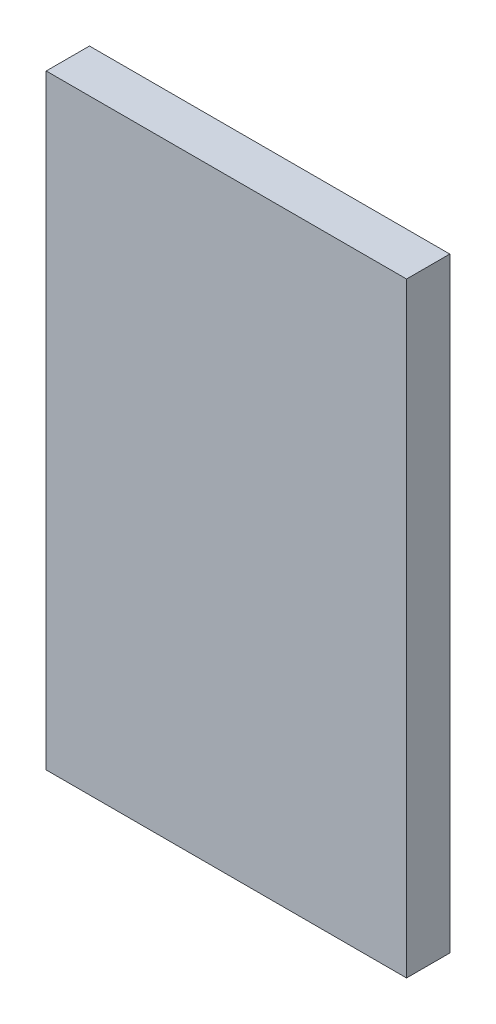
ISO-10303-21;
HEADER;
FILE_DESCRIPTION(('STEP AP214'),'2;1');
FILE_NAME('part.step','',(''),(''),'','','');
FILE_SCHEMA(('AUTOMOTIVE_DESIGN { 1 0 10303 214 1 1 1 1 }'));
ENDSEC;
DATA;
#1=APPLICATION_CONTEXT('core data for automotive mechanical design processes');
#2=APPLICATION_PROTOCOL_DEFINITION('international standard','automotive_design',2000,#1);
#3=PRODUCT_CONTEXT('',#1,'mechanical');
#4=PRODUCT('Part','Part','',(#3));
#5=PRODUCT_RELATED_PRODUCT_CATEGORY('part','',(#4));
#6=PRODUCT_DEFINITION_FORMATION('','',#4);
#7=PRODUCT_DEFINITION_CONTEXT('part definition',#1,'design');
#8=PRODUCT_DEFINITION('design','',#6,#7);
#9=PRODUCT_DEFINITION_SHAPE('','',#8);
#10=(LENGTH_UNIT() NAMED_UNIT(*) SI_UNIT(.MILLI.,.METRE.));
#11=(NAMED_UNIT(*) PLANE_ANGLE_UNIT() SI_UNIT($,.RADIAN.));
#12=(NAMED_UNIT(*) SI_UNIT($,.STERADIAN.) SOLID_ANGLE_UNIT());
#13=UNCERTAINTY_MEASURE_WITH_UNIT(LENGTH_MEASURE(1.E-05),#10,'distance_accuracy_value','');
#14=(GEOMETRIC_REPRESENTATION_CONTEXT(3) GLOBAL_UNCERTAINTY_ASSIGNED_CONTEXT((#13)) GLOBAL_UNIT_ASSIGNED_CONTEXT((#10,
#11,#12)) REPRESENTATION_CONTEXT('',''));
#15=CARTESIAN_POINT('',(0.,0.,0.));
#16=DIRECTION('',(0.,0.,1.));
#17=DIRECTION('',(1.,0.,0.));
#18=AXIS2_PLACEMENT_3D('',#15,#16,#17);
#19=CARTESIAN_POINT('',(0.,0.,30.));
#20=DIRECTION('',(1.,0.,0.));
#21=DIRECTION('',(0.,0.,-1.));
#22=AXIS2_PLACEMENT_3D('',#19,#20,#21);
#23=PLANE('',#22);
#24=DIRECTION('',(0.,-1.,0.));
#25=VECTOR('',#24,1.);
#26=CARTESIAN_POINT('',(0.,0.,0.));
#27=LINE('',#26,#25);
#28=CARTESIAN_POINT('',(0.,420.,0.));
#29=VERTEX_POINT('',#28);
#30=CARTESIAN_POINT('',(0.,0.,0.));
#31=VERTEX_POINT('',#30);
#32=EDGE_CURVE('E99',#29,#31,#27,.T.);
#33=ORIENTED_EDGE('',*,*,#32,.T.);
#34=DIRECTION('',(0.,0.,-1.));
#35=VECTOR('',#34,1.);
#36=CARTESIAN_POINT('',(0.,0.,30.));
#37=LINE('',#36,#35);
#38=CARTESIAN_POINT('',(0.,0.,30.));
#39=VERTEX_POINT('',#38);
#40=EDGE_CURVE('E11',#39,#31,#37,.T.);
#41=ORIENTED_EDGE('',*,*,#40,.F.);
#42=DIRECTION('',(0.,-1.,0.));
#43=VECTOR('',#42,1.);
#44=CARTESIAN_POINT('',(0.,0.,30.));
#45=LINE('',#44,#43);
#46=CARTESIAN_POINT('',(0.,420.,30.));
#47=VERTEX_POINT('',#46);
#48=EDGE_CURVE('E87',#47,#39,#45,.T.);
#49=ORIENTED_EDGE('',*,*,#48,.F.);
#50=DIRECTION('',(0.,0.,-1.));
#51=VECTOR('',#50,1.);
#52=CARTESIAN_POINT('',(0.,420.,30.));
#53=LINE('',#52,#51);
#54=EDGE_CURVE('E95',#47,#29,#53,.T.);
#55=ORIENTED_EDGE('',*,*,#54,.T.);
#56=EDGE_LOOP('',(#33,#41,#49,#55));
#57=FACE_BOUND('',#56,.T.);
#58=ADVANCED_FACE('F36',(#57),#23,.F.);
#59=CARTESIAN_POINT('',(0.,0.,30.));
#60=DIRECTION('',(0.,1.,0.));
#61=DIRECTION('',(0.,0.,1.));
#62=AXIS2_PLACEMENT_3D('',#59,#60,#61);
#63=PLANE('',#62);
#64=DIRECTION('',(1.,0.,0.));
#65=VECTOR('',#64,1.);
#66=CARTESIAN_POINT('',(0.,0.,0.));
#67=LINE('',#66,#65);
#68=CARTESIAN_POINT('',(250.,0.,0.));
#69=VERTEX_POINT('',#68);
#70=EDGE_CURVE('E91',#31,#69,#67,.T.);
#71=ORIENTED_EDGE('',*,*,#70,.T.);
#72=DIRECTION('',(0.,0.,-1.));
#73=VECTOR('',#72,1.);
#74=CARTESIAN_POINT('',(250.,0.,30.));
#75=LINE('',#74,#73);
#76=CARTESIAN_POINT('',(250.,0.,30.));
#77=VERTEX_POINT('',#76);
#78=EDGE_CURVE('E44',#77,#69,#75,.T.);
#79=ORIENTED_EDGE('',*,*,#78,.F.);
#80=DIRECTION('',(1.,0.,0.));
#81=VECTOR('',#80,1.);
#82=CARTESIAN_POINT('',(0.,0.,30.));
#83=LINE('',#82,#81);
#84=EDGE_CURVE('E82',#39,#77,#83,.T.);
#85=ORIENTED_EDGE('',*,*,#84,.F.);
#86=ORIENTED_EDGE('',*,*,#40,.T.);
#87=EDGE_LOOP('',(#71,#79,#85,#86));
#88=FACE_BOUND('',#87,.T.);
#89=ADVANCED_FACE('F90',(#88),#63,.F.);
#90=CARTESIAN_POINT('',(250.,0.,30.));
#91=DIRECTION('',(-1.,0.,0.));
#92=DIRECTION('',(0.,0.,1.));
#93=AXIS2_PLACEMENT_3D('',#90,#91,#92);
#94=PLANE('',#93);
#95=DIRECTION('',(0.,1.,0.));
#96=VECTOR('',#95,1.);
#97=CARTESIAN_POINT('',(250.,0.,0.));
#98=LINE('',#97,#96);
#99=CARTESIAN_POINT('',(250.,420.,0.));
#100=VERTEX_POINT('',#99);
#101=EDGE_CURVE('E69',#69,#100,#98,.T.);
#102=ORIENTED_EDGE('',*,*,#101,.T.);
#103=DIRECTION('',(0.,0.,-1.));
#104=VECTOR('',#103,1.);
#105=CARTESIAN_POINT('',(250.,420.,30.));
#106=LINE('',#105,#104);
#107=CARTESIAN_POINT('',(250.,420.,30.));
#108=VERTEX_POINT('',#107);
#109=EDGE_CURVE('E92',#108,#100,#106,.T.);
#110=ORIENTED_EDGE('',*,*,#109,.F.);
#111=DIRECTION('',(0.,1.,0.));
#112=VECTOR('',#111,1.);
#113=CARTESIAN_POINT('',(250.,0.,30.));
#114=LINE('',#113,#112);
#115=EDGE_CURVE('E85',#77,#108,#114,.T.);
#116=ORIENTED_EDGE('',*,*,#115,.F.);
#117=ORIENTED_EDGE('',*,*,#78,.T.);
#118=EDGE_LOOP('',(#102,#110,#116,#117));
#119=FACE_BOUND('',#118,.T.);
#120=ADVANCED_FACE('F93',(#119),#94,.F.);
#121=CARTESIAN_POINT('',(0.,420.,30.));
#122=DIRECTION('',(0.,-1.,0.));
#123=DIRECTION('',(0.,0.,-1.));
#124=AXIS2_PLACEMENT_3D('',#121,#122,#123);
#125=PLANE('',#124);
#126=DIRECTION('',(-1.,0.,0.));
#127=VECTOR('',#126,1.);
#128=CARTESIAN_POINT('',(0.,420.,0.));
#129=LINE('',#128,#127);
#130=EDGE_CURVE('E75',#100,#29,#129,.T.);
#131=ORIENTED_EDGE('',*,*,#130,.T.);
#132=ORIENTED_EDGE('',*,*,#54,.F.);
#133=DIRECTION('',(-1.,0.,0.));
#134=VECTOR('',#133,1.);
#135=CARTESIAN_POINT('',(0.,420.,30.));
#136=LINE('',#135,#134);
#137=EDGE_CURVE('E52',#108,#47,#136,.T.);
#138=ORIENTED_EDGE('',*,*,#137,.F.);
#139=ORIENTED_EDGE('',*,*,#109,.T.);
#140=EDGE_LOOP('',(#131,#132,#138,#139));
#141=FACE_BOUND('',#140,.T.);
#142=ADVANCED_FACE('F106',(#141),#125,.F.);
#143=CARTESIAN_POINT('',(0.,0.,30.));
#144=DIRECTION('',(0.,0.,-1.));
#145=DIRECTION('',(-1.,0.,0.));
#146=AXIS2_PLACEMENT_3D('',#143,#144,#145);
#147=PLANE('',#146);
#148=ORIENTED_EDGE('',*,*,#48,.T.);
#149=ORIENTED_EDGE('',*,*,#84,.T.);
#150=ORIENTED_EDGE('',*,*,#115,.T.);
#151=ORIENTED_EDGE('',*,*,#137,.T.);
#152=EDGE_LOOP('',(#148,#149,#150,#151));
#153=FACE_BOUND('',#152,.T.);
#154=ADVANCED_FACE('F83',(#153),#147,.F.);
#155=CARTESIAN_POINT('',(0.,0.,0.));
#156=DIRECTION('',(0.,0.,-1.));
#157=DIRECTION('',(-1.,0.,0.));
#158=AXIS2_PLACEMENT_3D('',#155,#156,#157);
#159=PLANE('',#158);
#160=ORIENTED_EDGE('',*,*,#32,.F.);
#161=ORIENTED_EDGE('',*,*,#130,.F.);
#162=ORIENTED_EDGE('',*,*,#101,.F.);
#163=ORIENTED_EDGE('',*,*,#70,.F.);
#164=EDGE_LOOP('',(#160,#161,#162,#163));
#165=FACE_BOUND('',#164,.T.);
#166=ADVANCED_FACE('F109',(#165),#159,.T.);
#167=CLOSED_SHELL('',(#58,#89,#120,#142,#154,#166));
#168=MANIFOLD_SOLID_BREP('B2',#167);
#169=ADVANCED_BREP_SHAPE_REPRESENTATION('',(#18,#168),#14);
#170=SHAPE_DEFINITION_REPRESENTATION(#9,#169);
ENDSEC;
END-ISO-10303-21;
